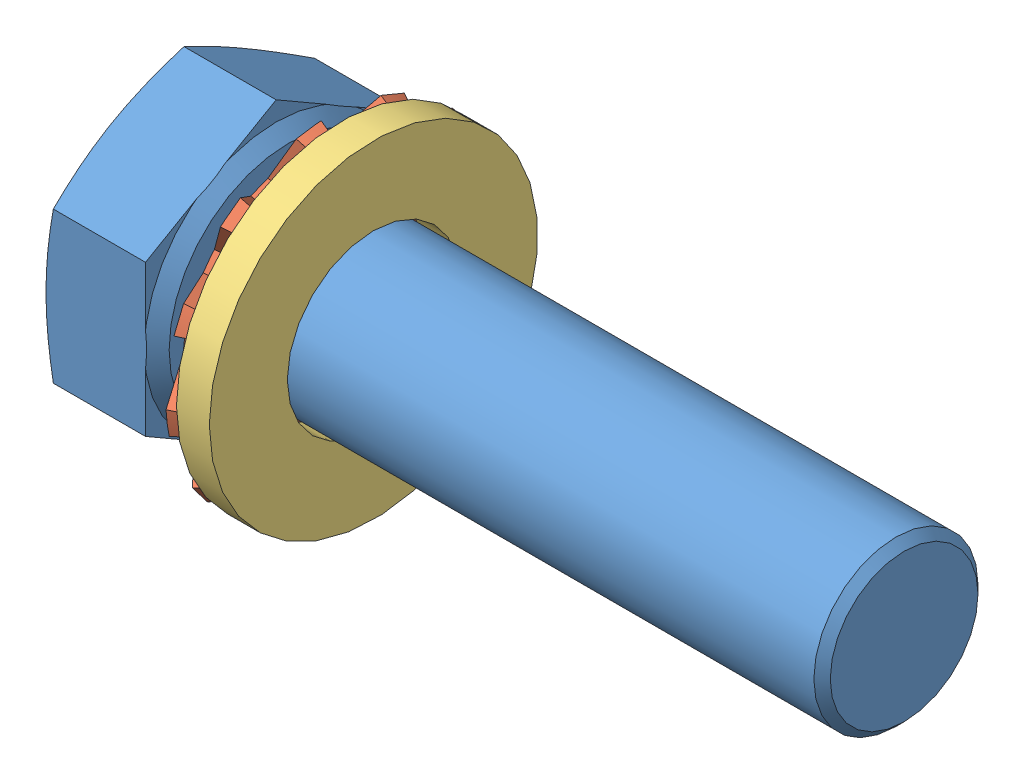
SolidWorks assembly Assemblage1.sldasm, configuration Défaut (file format 3400). Lengths in mm.
Overall size (35.45 20.54 20.54).
3 component instances, 3 part files, 4 mates.
Components (placement in the parent):
- Vis M8 30 mm-1: Vis M8 30 mm.SLDPRT [GB_FASTENER_BOLT_STBAB A M8X30-C] at origin size (35.45 14.7 12.73)
- Rondelle frein m8-1: Rondelle frein m8.SLDPRT [JIS B 1255 C 8] at (2.8519 0 0) x (-1 0 0) z (0 -0.924225 -0.381849) size (2.54 15.73 15.73)
- Rondelle M8-1: Rondelle M8.SLDPRT [Washer ISO 7089 - 8] at (9.5903 0 0) size (1.6 16 16)
Mates (geometry in assembly coordinates):
- Coaxiale11: concentric aligned: cylinder of ?; cone of ?
- Coïncidente1: coincident aligned: plane of ?; circle of ?
- Coaxiale2: concentric aligned: cylinder of ?; cylinder of ?
- Coïncidente2: coincident anti-aligned: circle of ?; plane of ?
